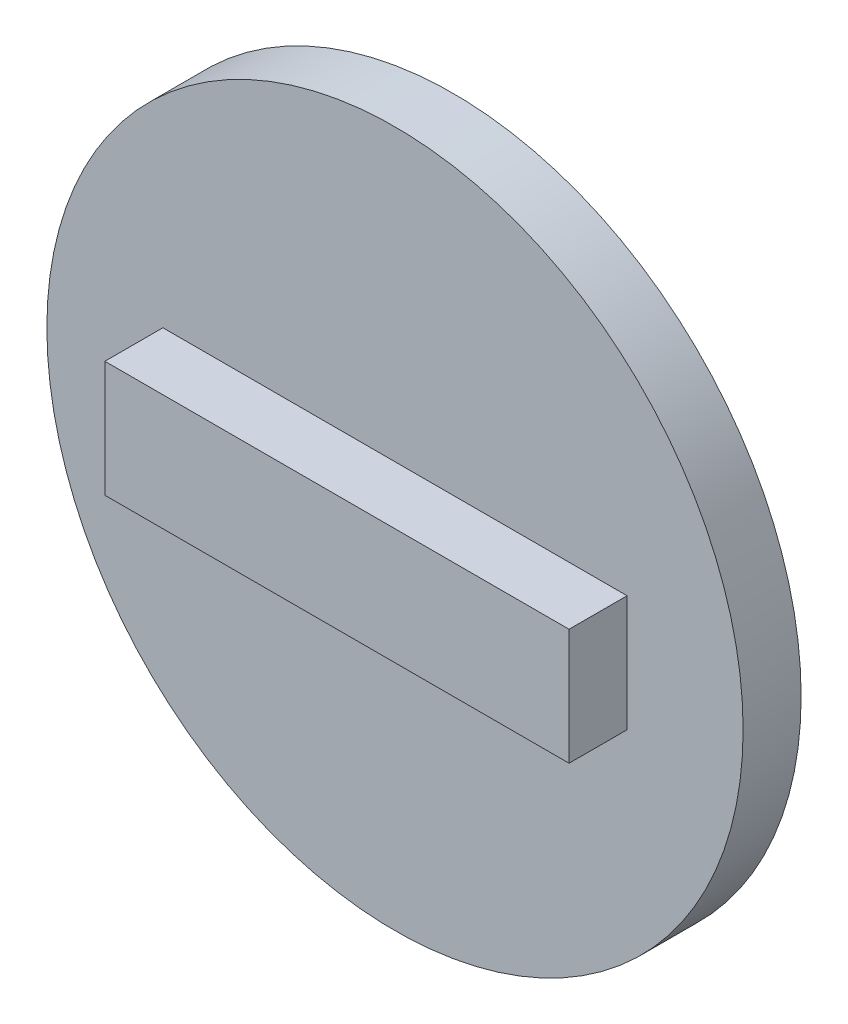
ISO-10303-21;
HEADER;
FILE_DESCRIPTION(('STEP AP214'),'2;1');
FILE_NAME('part.step','',(''),(''),'','','');
FILE_SCHEMA(('AUTOMOTIVE_DESIGN { 1 0 10303 214 1 1 1 1 }'));
ENDSEC;
DATA;
#1=APPLICATION_CONTEXT('core data for automotive mechanical design processes');
#2=APPLICATION_PROTOCOL_DEFINITION('international standard','automotive_design',2000,#1);
#3=PRODUCT_CONTEXT('',#1,'mechanical');
#4=PRODUCT('Part','Part','',(#3));
#5=PRODUCT_RELATED_PRODUCT_CATEGORY('part','',(#4));
#6=PRODUCT_DEFINITION_FORMATION('','',#4);
#7=PRODUCT_DEFINITION_CONTEXT('part definition',#1,'design');
#8=PRODUCT_DEFINITION('design','',#6,#7);
#9=PRODUCT_DEFINITION_SHAPE('','',#8);
#10=(LENGTH_UNIT() NAMED_UNIT(*) SI_UNIT(.MILLI.,.METRE.));
#11=(NAMED_UNIT(*) PLANE_ANGLE_UNIT() SI_UNIT($,.RADIAN.));
#12=(NAMED_UNIT(*) SI_UNIT($,.STERADIAN.) SOLID_ANGLE_UNIT());
#13=UNCERTAINTY_MEASURE_WITH_UNIT(LENGTH_MEASURE(1.E-05),#10,'distance_accuracy_value','');
#14=(GEOMETRIC_REPRESENTATION_CONTEXT(3) GLOBAL_UNCERTAINTY_ASSIGNED_CONTEXT((#13)) GLOBAL_UNIT_ASSIGNED_CONTEXT((#10,
#11,#12)) REPRESENTATION_CONTEXT('',''));
#15=CARTESIAN_POINT('',(0.,0.,0.));
#16=DIRECTION('',(0.,0.,1.));
#17=DIRECTION('',(1.,0.,0.));
#18=AXIS2_PLACEMENT_3D('',#15,#16,#17);
#19=CARTESIAN_POINT('',(0.,0.,3.175));
#20=DIRECTION('',(0.,0.,1.));
#21=DIRECTION('',(1.,0.,0.));
#22=AXIS2_PLACEMENT_3D('',#19,#20,#21);
#23=PLANE('',#22);
#24=CARTESIAN_POINT('',(0.,0.,3.175));
#25=DIRECTION('',(0.,0.,1.));
#26=DIRECTION('',(1.,0.,0.));
#27=AXIS2_PLACEMENT_3D('',#24,#25,#26);
#28=CIRCLE('',#27,19.05);
#29=CARTESIAN_POINT('',(19.05,0.,3.175));
#30=VERTEX_POINT('',#29);
#31=EDGE_CURVE('E11',#30,#30,#28,.T.);
#32=ORIENTED_EDGE('',*,*,#31,.T.);
#33=EDGE_LOOP('',(#32));
#34=FACE_BOUND('',#33,.T.);
#35=DIRECTION('',(1.,0.,0.));
#36=VECTOR('',#35,1.);
#37=CARTESIAN_POINT('',(-12.7,-3.175,3.175));
#38=LINE('',#37,#36);
#39=CARTESIAN_POINT('',(-12.7,-3.175,3.175));
#40=VERTEX_POINT('',#39);
#41=CARTESIAN_POINT('',(12.7,-3.175,3.175));
#42=VERTEX_POINT('',#41);
#43=EDGE_CURVE('E76',#40,#42,#38,.T.);
#44=ORIENTED_EDGE('',*,*,#43,.F.);
#45=DIRECTION('',(0.,-1.,0.));
#46=VECTOR('',#45,1.);
#47=CARTESIAN_POINT('',(-12.7,3.175,3.175));
#48=LINE('',#47,#46);
#49=CARTESIAN_POINT('',(-12.7,3.175,3.175));
#50=VERTEX_POINT('',#49);
#51=EDGE_CURVE('E85',#50,#40,#48,.T.);
#52=ORIENTED_EDGE('',*,*,#51,.F.);
#53=DIRECTION('',(-1.,0.,0.));
#54=VECTOR('',#53,1.);
#55=CARTESIAN_POINT('',(-12.7,3.175,3.175));
#56=LINE('',#55,#54);
#57=CARTESIAN_POINT('',(12.7,3.175,3.175));
#58=VERTEX_POINT('',#57);
#59=EDGE_CURVE('E94',#58,#50,#56,.T.);
#60=ORIENTED_EDGE('',*,*,#59,.F.);
#61=DIRECTION('',(0.,1.,0.));
#62=VECTOR('',#61,1.);
#63=CARTESIAN_POINT('',(12.7,3.175,3.175));
#64=LINE('',#63,#62);
#65=EDGE_CURVE('E92',#42,#58,#64,.T.);
#66=ORIENTED_EDGE('',*,*,#65,.F.);
#67=EDGE_LOOP('',(#44,#52,#60,#66));
#68=FACE_BOUND('',#67,.T.);
#69=ADVANCED_FACE('F30',(#34,#68),#23,.T.);
#70=CARTESIAN_POINT('',(0.,0.,3.175));
#71=DIRECTION('',(0.,0.,-1.));
#72=DIRECTION('',(-1.,0.,0.));
#73=AXIS2_PLACEMENT_3D('',#70,#71,#72);
#74=CYLINDRICAL_SURFACE('',#73,19.05);
#75=ORIENTED_EDGE('',*,*,#31,.F.);
#76=EDGE_LOOP('',(#75));
#77=FACE_BOUND('',#76,.T.);
#78=CARTESIAN_POINT('',(0.,0.,0.));
#79=DIRECTION('',(0.,0.,1.));
#80=DIRECTION('',(1.,0.,0.));
#81=AXIS2_PLACEMENT_3D('',#78,#79,#80);
#82=CIRCLE('',#81,19.05);
#83=CARTESIAN_POINT('',(19.05,0.,0.));
#84=VERTEX_POINT('',#83);
#85=EDGE_CURVE('E38',#84,#84,#82,.T.);
#86=ORIENTED_EDGE('',*,*,#85,.T.);
#87=EDGE_LOOP('',(#86));
#88=FACE_BOUND('',#87,.T.);
#89=ADVANCED_FACE('F32',(#77,#88),#74,.T.);
#90=CARTESIAN_POINT('',(0.,0.,0.));
#91=DIRECTION('',(0.,0.,1.));
#92=DIRECTION('',(1.,0.,0.));
#93=AXIS2_PLACEMENT_3D('',#90,#91,#92);
#94=PLANE('',#93);
#95=ORIENTED_EDGE('',*,*,#85,.F.);
#96=EDGE_LOOP('',(#95));
#97=FACE_BOUND('',#96,.T.);
#98=ADVANCED_FACE('F110',(#97),#94,.F.);
#99=CARTESIAN_POINT('',(-12.7,3.175,6.35));
#100=DIRECTION('',(1.,0.,0.));
#101=DIRECTION('',(0.,0.,-1.));
#102=AXIS2_PLACEMENT_3D('',#99,#100,#101);
#103=PLANE('',#102);
#104=ORIENTED_EDGE('',*,*,#51,.T.);
#105=DIRECTION('',(0.,0.,-1.));
#106=VECTOR('',#105,1.);
#107=CARTESIAN_POINT('',(-12.7,-3.175,6.35));
#108=LINE('',#107,#106);
#109=CARTESIAN_POINT('',(-12.7,-3.175,6.35));
#110=VERTEX_POINT('',#109);
#111=EDGE_CURVE('E71',#110,#40,#108,.T.);
#112=ORIENTED_EDGE('',*,*,#111,.F.);
#113=DIRECTION('',(0.,-1.,0.));
#114=VECTOR('',#113,1.);
#115=CARTESIAN_POINT('',(-12.7,3.175,6.35));
#116=LINE('',#115,#114);
#117=CARTESIAN_POINT('',(-12.7,3.175,6.35));
#118=VERTEX_POINT('',#117);
#119=EDGE_CURVE('E98',#118,#110,#116,.T.);
#120=ORIENTED_EDGE('',*,*,#119,.F.);
#121=DIRECTION('',(0.,0.,-1.));
#122=VECTOR('',#121,1.);
#123=CARTESIAN_POINT('',(-12.7,3.175,6.35));
#124=LINE('',#123,#122);
#125=EDGE_CURVE('E87',#118,#50,#124,.T.);
#126=ORIENTED_EDGE('',*,*,#125,.T.);
#127=EDGE_LOOP('',(#104,#112,#120,#126));
#128=FACE_BOUND('',#127,.T.);
#129=ADVANCED_FACE('F86',(#128),#103,.F.);
#130=CARTESIAN_POINT('',(-12.7,-3.175,6.35));
#131=DIRECTION('',(0.,1.,0.));
#132=DIRECTION('',(0.,0.,1.));
#133=AXIS2_PLACEMENT_3D('',#130,#131,#132);
#134=PLANE('',#133);
#135=ORIENTED_EDGE('',*,*,#43,.T.);
#136=DIRECTION('',(0.,0.,-1.));
#137=VECTOR('',#136,1.);
#138=CARTESIAN_POINT('',(12.7,-3.175,6.35));
#139=LINE('',#138,#137);
#140=CARTESIAN_POINT('',(12.7,-3.175,6.35));
#141=VERTEX_POINT('',#140);
#142=EDGE_CURVE('E81',#141,#42,#139,.T.);
#143=ORIENTED_EDGE('',*,*,#142,.F.);
#144=DIRECTION('',(1.,0.,0.));
#145=VECTOR('',#144,1.);
#146=CARTESIAN_POINT('',(-12.7,-3.175,6.35));
#147=LINE('',#146,#145);
#148=EDGE_CURVE('E78',#110,#141,#147,.T.);
#149=ORIENTED_EDGE('',*,*,#148,.F.);
#150=ORIENTED_EDGE('',*,*,#111,.T.);
#151=EDGE_LOOP('',(#135,#143,#149,#150));
#152=FACE_BOUND('',#151,.T.);
#153=ADVANCED_FACE('F73',(#152),#134,.F.);
#154=CARTESIAN_POINT('',(12.7,3.175,6.35));
#155=DIRECTION('',(-1.,0.,0.));
#156=DIRECTION('',(0.,0.,1.));
#157=AXIS2_PLACEMENT_3D('',#154,#155,#156);
#158=PLANE('',#157);
#159=ORIENTED_EDGE('',*,*,#65,.T.);
#160=DIRECTION('',(0.,0.,-1.));
#161=VECTOR('',#160,1.);
#162=CARTESIAN_POINT('',(12.7,3.175,6.35));
#163=LINE('',#162,#161);
#164=CARTESIAN_POINT('',(12.7,3.175,6.35));
#165=VERTEX_POINT('',#164);
#166=EDGE_CURVE('E45',#165,#58,#163,.T.);
#167=ORIENTED_EDGE('',*,*,#166,.F.);
#168=DIRECTION('',(0.,1.,0.));
#169=VECTOR('',#168,1.);
#170=CARTESIAN_POINT('',(12.7,3.175,6.35));
#171=LINE('',#170,#169);
#172=EDGE_CURVE('E101',#141,#165,#171,.T.);
#173=ORIENTED_EDGE('',*,*,#172,.F.);
#174=ORIENTED_EDGE('',*,*,#142,.T.);
#175=EDGE_LOOP('',(#159,#167,#173,#174));
#176=FACE_BOUND('',#175,.T.);
#177=ADVANCED_FACE('F149',(#176),#158,.F.);
#178=CARTESIAN_POINT('',(-12.7,3.175,6.35));
#179=DIRECTION('',(0.,-1.,0.));
#180=DIRECTION('',(0.,0.,-1.));
#181=AXIS2_PLACEMENT_3D('',#178,#179,#180);
#182=PLANE('',#181);
#183=ORIENTED_EDGE('',*,*,#59,.T.);
#184=ORIENTED_EDGE('',*,*,#125,.F.);
#185=DIRECTION('',(-1.,0.,0.));
#186=VECTOR('',#185,1.);
#187=CARTESIAN_POINT('',(-12.7,3.175,6.35));
#188=LINE('',#187,#186);
#189=EDGE_CURVE('E52',#165,#118,#188,.T.);
#190=ORIENTED_EDGE('',*,*,#189,.F.);
#191=ORIENTED_EDGE('',*,*,#166,.T.);
#192=EDGE_LOOP('',(#183,#184,#190,#191));
#193=FACE_BOUND('',#192,.T.);
#194=ADVANCED_FACE('F157',(#193),#182,.F.);
#195=CARTESIAN_POINT('',(-12.7,-3.175,6.35));
#196=DIRECTION('',(0.,0.,1.));
#197=DIRECTION('',(1.,0.,0.));
#198=AXIS2_PLACEMENT_3D('',#195,#196,#197);
#199=PLANE('',#198);
#200=ORIENTED_EDGE('',*,*,#119,.T.);
#201=ORIENTED_EDGE('',*,*,#148,.T.);
#202=ORIENTED_EDGE('',*,*,#172,.T.);
#203=ORIENTED_EDGE('',*,*,#189,.T.);
#204=EDGE_LOOP('',(#200,#201,#202,#203));
#205=FACE_BOUND('',#204,.T.);
#206=ADVANCED_FACE('F166',(#205),#199,.T.);
#207=CLOSED_SHELL('',(#69,#89,#98,#129,#153,#177,#194,#206));
#208=MANIFOLD_SOLID_BREP('B2',#207);
#209=ADVANCED_BREP_SHAPE_REPRESENTATION('',(#18,#208),#14);
#210=SHAPE_DEFINITION_REPRESENTATION(#9,#209);
ENDSEC;
END-ISO-10303-21;
